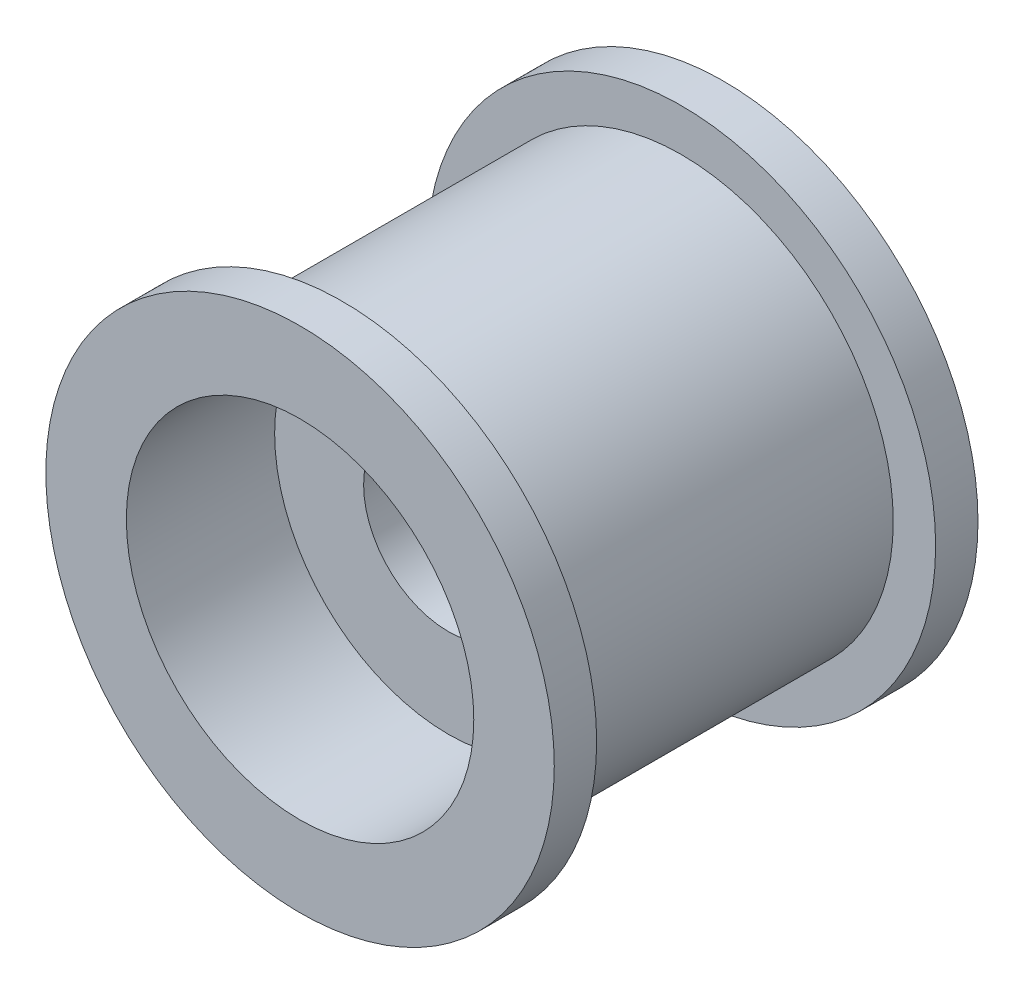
from build123d import *

# Parameters (mm, degrees)
SKETCH_1_R          = 6
EXTRUDE_1_DEPTH     = 10
CUT_EXTRUDE_START   = -9
SKETCH_2_R          = 6
SKETCH_2_R_2        = 5
CUT_EXTRUDE_1_DEPTH = 8
SKETCH_3_R          = 4.1
CUT_EXTRUDE_2_DEPTH = 3.5
SKETCH_4_R          = 2
CUT_EXTRUDE_3_DEPTH = 11.688779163


with BuildPart() as part:
    # Sketch 1 → Extrude 1 (new body)
    with BuildSketch(Plane.XY):
        Circle(SKETCH_1_R)
    extrude(amount=EXTRUDE_1_DEPTH)

    # Sketch 2 → Cut-Extrude 1 (cut)
    with BuildSketch(Plane.XY.offset(10).offset(CUT_EXTRUDE_START)):
        Circle(SKETCH_2_R)
        Circle(SKETCH_2_R_2, mode=Mode.SUBTRACT)
    extrude(amount=CUT_EXTRUDE_1_DEPTH, mode=Mode.SUBTRACT)

    # Sketch 3 → Cut-Extrude 2 (cut)
    with BuildSketch(Plane.XY.offset(10)):
        Circle(SKETCH_3_R)
    cut_extrude_2 = extrude(amount=-CUT_EXTRUDE_2_DEPTH, mode=Mode.SUBTRACT)

    # Mirror 1: Cut-Extrude 2 across plane
    add(cut_extrude_2.mirror(Plane.XY.offset(5)), mode=Mode.SUBTRACT)

    # Sketch 4 → Cut-Extrude 3 (cut, through all)
    with BuildSketch(Plane(origin=(0, 0, 3.5), x_dir=(-1, 0, 0), z_dir=(0, 0, -1))):
        Circle(SKETCH_4_R)
    extrude(amount=-CUT_EXTRUDE_3_DEPTH, mode=Mode.SUBTRACT)


solid = part.part
